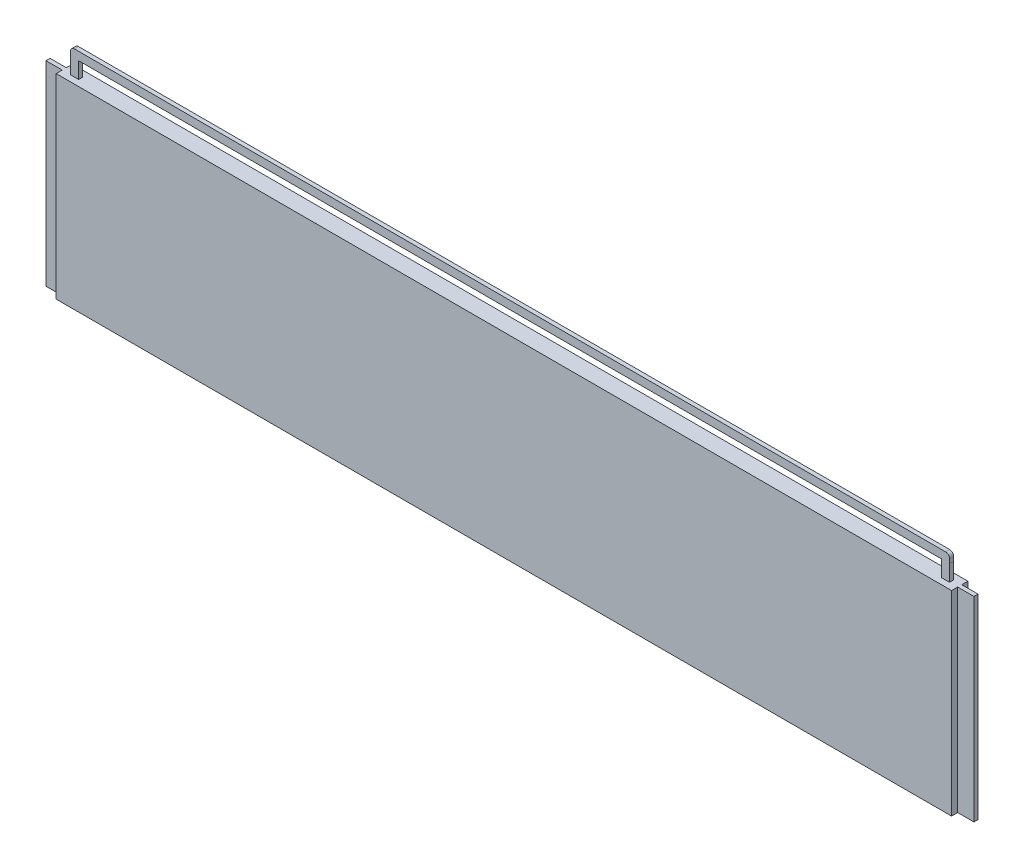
from build123d import *

# Parameters (mm, degrees)
BOSS_EXTRUDE2_DEPTH = 304.8
SKETCH3_W           = 12.801861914
SKETCH3_H           = 6.35
SKETCH3_W_2         = 12.7
BOSS_EXTRUDE3_DEPTH = 25.4
SKETCH5_W           = 1371.759378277
SKETCH5_H           = 6.35
BOSS_EXTRUDE4_DEPTH = 12.7
FILLET1_R           = 6.35


with BuildPart() as part:
    # Sketch2 → Boss-Extrude2 (new body)
    with BuildSketch(Plane(origin=(0, 0, 0), x_dir=(1, 0, 0), z_dir=(0, 1, 0))):
        Polygon((-1341.572104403, 9.525), (55.427895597, 9.525), (55.427895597, 0), (80.827895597, 0), (80.827895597, -3.175), (80.827895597, -6.35), (55.427895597, -6.35), (55.427895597, -15.875), (-1341.572104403, -15.875), (-1341.572104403, -6.35), (-1366.972104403, -6.35), (-1366.972104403, -3.175), (-1366.972104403, 0), (-1341.572104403, 0), align=None)
    extrude(amount=BOSS_EXTRUDE2_DEPTH)

    # Sketch3 → Boss-Extrude3 (add)
    with BuildSketch(Plane(origin=(0, 304.8, 0), x_dir=(-1, 0, 0), z_dir=(0, 1, 0))):
        with Locations((1322.471173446, 3.175)):
            Rectangle(SKETCH3_W, SKETCH3_H)
        with Locations((-36.377895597, 3.175)):
            Rectangle(SKETCH3_W_2, SKETCH3_H)
    extrude(amount=BOSS_EXTRUDE3_DEPTH)

    # Sketch5 → Boss-Extrude4 (add)
    with BuildSketch(Plane(origin=(0, 330.2, 0), x_dir=(-1, 0, 0), z_dir=(0, 1, 0))):
        with Locations((642.992415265, 3.175)):
            Rectangle(SKETCH5_W, SKETCH5_H)
    extrude(amount=BOSS_EXTRUDE4_DEPTH)

    # Fillet1
    fillet1_edges = [part.edges().sort_by_distance(p)[0] for p in [
        (-1328.872104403, 342.9, 3.175),
        (42.887273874, 342.9, 3.175),
    ]]
    fillet(fillet1_edges, radius=FILLET1_R)


solid = part.part
